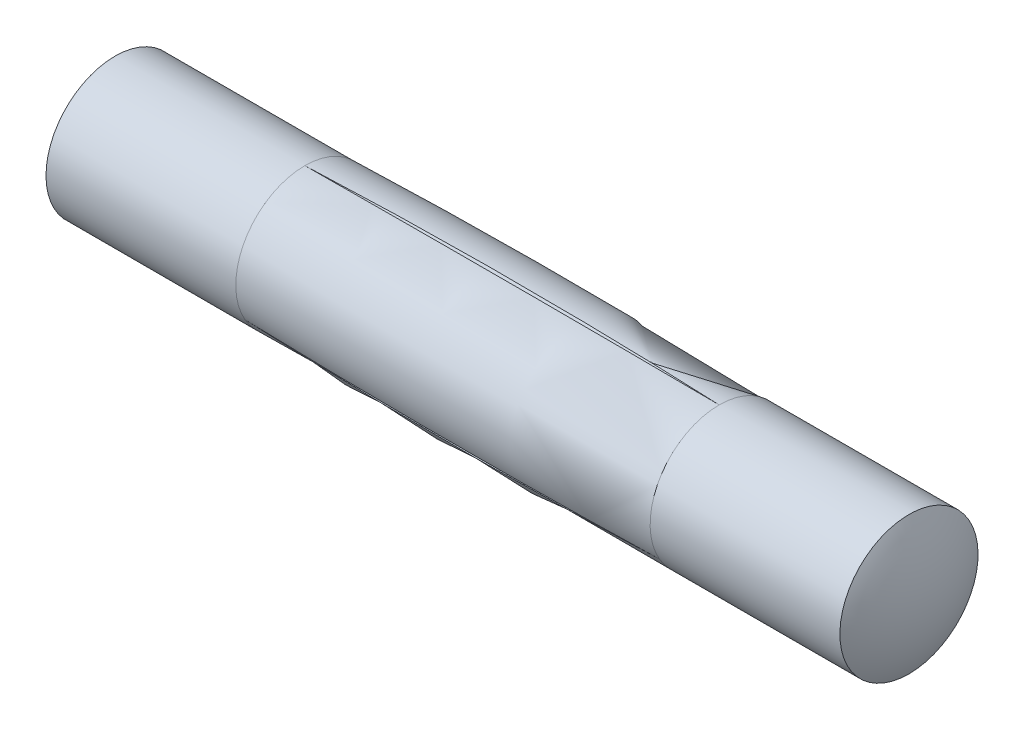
ISO-10303-21;
HEADER;
FILE_DESCRIPTION(('STEP AP214'),'2;1');
FILE_NAME('part.step','',(''),(''),'','','');
FILE_SCHEMA(('AUTOMOTIVE_DESIGN { 1 0 10303 214 1 1 1 1 }'));
ENDSEC;
DATA;
#1=APPLICATION_CONTEXT('core data for automotive mechanical design processes');
#2=APPLICATION_PROTOCOL_DEFINITION('international standard','automotive_design',2000,#1);
#3=PRODUCT_CONTEXT('',#1,'mechanical');
#4=PRODUCT('Part','Part','',(#3));
#5=PRODUCT_RELATED_PRODUCT_CATEGORY('part','',(#4));
#6=PRODUCT_DEFINITION_FORMATION('','',#4);
#7=PRODUCT_DEFINITION_CONTEXT('part definition',#1,'design');
#8=PRODUCT_DEFINITION('design','',#6,#7);
#9=PRODUCT_DEFINITION_SHAPE('','',#8);
#10=(LENGTH_UNIT() NAMED_UNIT(*) SI_UNIT(.MILLI.,.METRE.));
#11=(NAMED_UNIT(*) PLANE_ANGLE_UNIT() SI_UNIT($,.RADIAN.));
#12=(NAMED_UNIT(*) SI_UNIT($,.STERADIAN.) SOLID_ANGLE_UNIT());
#13=UNCERTAINTY_MEASURE_WITH_UNIT(LENGTH_MEASURE(1.E-05),#10,'distance_accuracy_value','');
#14=(GEOMETRIC_REPRESENTATION_CONTEXT(3) GLOBAL_UNCERTAINTY_ASSIGNED_CONTEXT((#13)) GLOBAL_UNIT_ASSIGNED_CONTEXT((#10,
#11,#12)) REPRESENTATION_CONTEXT('',''));
#15=CARTESIAN_POINT('',(0.,0.,0.));
#16=DIRECTION('',(0.,0.,1.));
#17=DIRECTION('',(1.,0.,0.));
#18=AXIS2_PLACEMENT_3D('',#15,#16,#17);
#19=CARTESIAN_POINT('',(0.,0.,0.));
#20=DIRECTION('',(-1.,0.,0.));
#21=DIRECTION('',(0.,0.,1.));
#22=AXIS2_PLACEMENT_3D('',#19,#20,#21);
#23=DEGENERATE_TOROIDAL_SURFACE('',#22,278.700000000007,281.300000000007,.F.);
#24=CARTESIAN_POINT('',(-7.5,0.,0.));
#25=DIRECTION('',(1.,0.,0.));
#26=DIRECTION('',(0.,0.,-1.));
#27=AXIS2_PLACEMENT_3D('',#24,#25,#26);
#28=CIRCLE('',#27,2.5);
#29=CARTESIAN_POINT('',(-7.5,-1.25000000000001,2.16506350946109));
#30=VERTEX_POINT('',#29);
#31=CARTESIAN_POINT('',(-7.5,-1.24999999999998,-2.16506350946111));
#32=VERTEX_POINT('',#31);
#33=EDGE_CURVE('E93',#30,#32,#28,.T.);
#34=ORIENTED_EDGE('',*,*,#33,.T.);
#35=CARTESIAN_POINT('',(-7.5002,-1.2499940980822,-2.16506075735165));
#36=CARTESIAN_POINT('',(-7.09450307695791,-1.26196494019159,-2.17064285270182));
#37=CARTESIAN_POINT('',(-6.68877093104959,-1.27292932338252,-2.1757556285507));
#38=CARTESIAN_POINT('',(-5.87724910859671,-1.29287496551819,-2.18505643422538));
#39=CARTESIAN_POINT('',(-5.47145943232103,-1.3018562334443,-2.18924446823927));
#40=CARTESIAN_POINT('',(-4.2541563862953,-1.32586747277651,-2.20044109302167));
#41=CARTESIAN_POINT('',(-3.44257061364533,-1.33796894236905,-2.2060841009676));
#42=CARTESIAN_POINT('',(-1.78665400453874,-1.35483163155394,-2.2139473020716));
#43=CARTESIAN_POINT('',(-0.942319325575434,-1.3592779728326,-2.21602066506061));
#44=CARTESIAN_POINT('',(0.746359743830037,-1.35991616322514,-2.21631825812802));
#45=CARTESIAN_POINT('',(1.59070413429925,-1.35610795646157,-2.21454246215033));
#46=CARTESIAN_POINT('',(3.27936808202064,-1.34020085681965,-2.20712485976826));
#47=CARTESIAN_POINT('',(4.12368763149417,-1.32810128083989,-2.20148273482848));
#48=CARTESIAN_POINT('',(5.81212227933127,-1.29543847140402,-2.18625181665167));
#49=CARTESIAN_POINT('',(6.65623737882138,-1.27487528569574,-2.17666304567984));
#50=CARTESIAN_POINT('',(7.5002,-1.24999409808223,-2.16506075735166));
#51=B_SPLINE_CURVE_WITH_KNOTS('',3,(#35,#36,#37,#38,#39,#40,#41,#42,#43,#44,#45,#46,#47,#48,#49,
#50),.UNSPECIFIED.,.F.,.F.,(4,2,2,2,2,2,2,4),(0.,1.2177323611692,2.4354592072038,
4.87049754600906,7.40349583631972,9.9365112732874,12.4697354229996,15.0029452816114),.UNSPECIFIED.);
#52=CARTESIAN_POINT('',(7.5,-1.24999999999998,-2.16506350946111));
#53=VERTEX_POINT('',#52);
#54=EDGE_CURVE('E55',#32,#53,#51,.T.);
#55=ORIENTED_EDGE('',*,*,#54,.T.);
#56=CARTESIAN_POINT('',(7.5,0.,0.));
#57=DIRECTION('',(-1.,0.,0.));
#58=DIRECTION('',(0.,0.,1.));
#59=AXIS2_PLACEMENT_3D('',#56,#57,#58);
#60=CIRCLE('',#59,2.5);
#61=CARTESIAN_POINT('',(7.5,-1.25000000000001,2.16506350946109));
#62=VERTEX_POINT('',#61);
#63=EDGE_CURVE('E90',#53,#62,#60,.T.);
#64=ORIENTED_EDGE('',*,*,#63,.T.);
#65=CARTESIAN_POINT('',(7.5002,-1.24999409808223,2.16506075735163));
#66=CARTESIAN_POINT('',(7.09450307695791,-1.26196494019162,2.17064285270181));
#67=CARTESIAN_POINT('',(6.68877093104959,-1.27292932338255,2.17575562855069));
#68=CARTESIAN_POINT('',(5.87724910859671,-1.29287496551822,2.18505643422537));
#69=CARTESIAN_POINT('',(5.47145943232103,-1.30185623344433,2.18924446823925));
#70=CARTESIAN_POINT('',(4.2541563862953,-1.32586747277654,2.20044109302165));
#71=CARTESIAN_POINT('',(3.44257061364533,-1.33796894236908,2.20608410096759));
#72=CARTESIAN_POINT('',(1.78665400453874,-1.35483163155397,2.21394730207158));
#73=CARTESIAN_POINT('',(0.942319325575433,-1.35927797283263,2.21602066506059));
#74=CARTESIAN_POINT('',(-0.74635974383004,-1.35991616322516,2.216318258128));
#75=CARTESIAN_POINT('',(-1.59070413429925,-1.3561079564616,2.21454246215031));
#76=CARTESIAN_POINT('',(-3.27936808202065,-1.34020085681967,2.20712485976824));
#77=CARTESIAN_POINT('',(-4.12368763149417,-1.32810128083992,2.20148273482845));
#78=CARTESIAN_POINT('',(-5.81212227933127,-1.29543847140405,2.18625181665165));
#79=CARTESIAN_POINT('',(-6.65623737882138,-1.27487528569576,2.17666304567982));
#80=CARTESIAN_POINT('',(-7.5002,-1.24999409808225,2.16506075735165));
#81=B_SPLINE_CURVE_WITH_KNOTS('',3,(#65,#66,#67,#68,#69,#70,#71,#72,#73,#74,#75,#76,#77,#78,#79,
#80),.UNSPECIFIED.,.F.,.F.,(4,2,2,2,2,2,2,4),(0.,1.21773236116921,2.4354592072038,
4.87049754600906,7.40349583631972,9.93651127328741,12.4697354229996,15.0029452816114),.UNSPECIFIED.);
#82=EDGE_CURVE('E94',#62,#30,#81,.T.);
#83=ORIENTED_EDGE('',*,*,#82,.T.);
#84=EDGE_LOOP('',(#34,#55,#64,#83));
#85=FACE_BOUND('',#84,.T.);
#86=ADVANCED_FACE('F35',(#85),#23,.F.);
#87=CARTESIAN_POINT('',(-7.5,2.5,0.));
#88=VERTEX_POINT('',#87);
#89=EDGE_CURVE('E107',#88,#30,#28,.T.);
#90=ORIENTED_EDGE('',*,*,#89,.T.);
#91=CARTESIAN_POINT('',(-7.5002,-1.2500005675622,2.16505702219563));
#92=CARTESIAN_POINT('',(-7.09450307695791,-1.2488493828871,2.17821512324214));
#93=CARTESIAN_POINT('',(-6.68877093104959,-1.24779498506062,2.19026694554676));
#94=CARTESIAN_POINT('',(-5.87724910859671,-1.24587689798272,2.21219078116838));
#95=CARTESIAN_POINT('',(-5.47145943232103,-1.2450132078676,2.22206280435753));
#96=CARTESIAN_POINT('',(-4.2541563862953,-1.2427041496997,2.24845545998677));
#97=CARTESIAN_POINT('',(-3.44257061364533,-1.24154040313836,2.26175714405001));
#98=CARTESIAN_POINT('',(-1.78665400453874,-1.23991879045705,2.28029226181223));
#99=CARTESIAN_POINT('',(-0.942319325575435,-1.23949120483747,2.28517958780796));
#100=CARTESIAN_POINT('',(0.746359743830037,-1.23942983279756,2.28588107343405));
#101=CARTESIAN_POINT('',(1.59070413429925,-1.23979605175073,2.28169517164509));
#102=CARTESIAN_POINT('',(3.27936808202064,-1.24132576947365,2.26421041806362));
#103=CARTESIAN_POINT('',(4.12368763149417,-1.24248933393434,2.25091081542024));
#104=CARTESIAN_POINT('',(5.81212227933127,-1.24563037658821,2.21500853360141));
#105=CARTESIAN_POINT('',(6.65623737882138,-1.24760785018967,2.19240590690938));
#106=CARTESIAN_POINT('',(7.5002,-1.25000056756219,2.16505702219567));
#107=B_SPLINE_CURVE_WITH_KNOTS('',3,(#91,#92,#93,#94,#95,#96,#97,#98,#99,#100,#101,#102,#103,
#104,#105,#106),.UNSPECIFIED.,.F.,.F.,(4,2,2,2,2,2,2,4),(0.,1.2177323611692,2.4354592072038,
4.87049754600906,7.40349583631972,9.9365112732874,12.4697354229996,15.0029452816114),.UNSPECIFIED.);
#108=EDGE_CURVE('E62',#30,#62,#107,.T.);
#109=ORIENTED_EDGE('',*,*,#108,.T.);
#110=CARTESIAN_POINT('',(7.5,2.5,0.));
#111=VERTEX_POINT('',#110);
#112=EDGE_CURVE('E101',#62,#111,#60,.T.);
#113=ORIENTED_EDGE('',*,*,#112,.T.);
#114=CARTESIAN_POINT('',(7.5002,2.49999466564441,-3.73515600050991E-06));
#115=CARTESIAN_POINT('',(7.09450307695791,2.51081432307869,0.00757227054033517));
#116=CARTESIAN_POINT('',(6.68877093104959,2.52072430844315,0.0145113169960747));
#117=CARTESIAN_POINT('',(5.87724910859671,2.53875186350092,0.0271343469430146));
#118=CARTESIAN_POINT('',(5.47145943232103,2.54686944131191,0.0328183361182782));
#119=CARTESIAN_POINT('',(4.2541563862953,2.56857162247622,0.0480143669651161));
#120=CARTESIAN_POINT('',(3.44257061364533,2.57950934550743,0.0556730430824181));
#121=CARTESIAN_POINT('',(1.78665400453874,2.59475042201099,0.0663449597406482));
#122=CARTESIAN_POINT('',(0.942319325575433,2.59876917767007,0.0691589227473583));
#123=CARTESIAN_POINT('',(-0.74635974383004,2.5993459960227,0.0695628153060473));
#124=CARTESIAN_POINT('',(-1.59070413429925,2.59590400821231,0.0671527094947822));
#125=CARTESIAN_POINT('',(-3.27936808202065,2.5815266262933,0.057085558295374));
#126=CARTESIAN_POINT('',(-4.12368763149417,2.57059061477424,0.0494280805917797));
#127=CARTESIAN_POINT('',(-5.81212227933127,2.54106884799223,0.0287567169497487));
#128=CARTESIAN_POINT('',(-6.65623737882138,2.52248313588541,0.0157428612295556));
#129=CARTESIAN_POINT('',(-7.5002,2.49999466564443,-3.73515598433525E-06));
#130=B_SPLINE_CURVE_WITH_KNOTS('',3,(#114,#115,#116,#117,#118,#119,#120,#121,#122,#123,#124,
#125,#126,#127,#128,#129),.UNSPECIFIED.,.F.,.F.,(4,2,2,2,2,2,2,4),(0.,1.21773236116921,
2.4354592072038,4.87049754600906,7.40349583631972,9.93651127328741,12.4697354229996,
15.0029452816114),.UNSPECIFIED.);
#131=EDGE_CURVE('E49',#111,#88,#130,.T.);
#132=ORIENTED_EDGE('',*,*,#131,.T.);
#133=EDGE_LOOP('',(#90,#109,#113,#132));
#134=FACE_BOUND('',#133,.T.);
#135=ADVANCED_FACE('F169',(#134),#23,.F.);
#136=CARTESIAN_POINT('',(-15.,0.,0.));
#137=DIRECTION('',(-1.,0.,0.));
#138=DIRECTION('',(0.,-1.,0.));
#139=AXIS2_PLACEMENT_3D('',#136,#137,#138);
#140=CYLINDRICAL_SURFACE('',#139,2.5);
#141=CARTESIAN_POINT('',(14.37,0.,0.));
#142=DIRECTION('',(-1.,0.,0.));
#143=DIRECTION('',(0.,-1.,0.));
#144=AXIS2_PLACEMENT_3D('',#141,#142,#143);
#145=CIRCLE('',#144,2.5);
#146=CARTESIAN_POINT('',(14.37,-2.5,0.));
#147=VERTEX_POINT('',#146);
#148=EDGE_CURVE('E114',#147,#147,#145,.T.);
#149=ORIENTED_EDGE('',*,*,#148,.T.);
#150=EDGE_LOOP('',(#149));
#151=FACE_BOUND('',#150,.T.);
#152=EDGE_CURVE('E100',#111,#53,#60,.T.);
#153=ORIENTED_EDGE('',*,*,#152,.F.);
#154=ORIENTED_EDGE('',*,*,#112,.F.);
#155=ORIENTED_EDGE('',*,*,#63,.F.);
#156=EDGE_LOOP('',(#153,#154,#155));
#157=FACE_BOUND('',#156,.T.);
#158=ADVANCED_FACE('F99',(#151,#157),#140,.T.);
#159=CARTESIAN_POINT('',(9.72468253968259,0.,0.));
#160=DIRECTION('',(-1.,0.,0.));
#161=DIRECTION('',(0.,-1.,0.));
#162=AXIS2_PLACEMENT_3D('',#159,#160,#161);
#163=SPHERICAL_SURFACE('',#162,5.27531746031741);
#164=ORIENTED_EDGE('',*,*,#148,.F.);
#165=EDGE_LOOP('',(#164));
#166=FACE_BOUND('',#165,.T.);
#167=ADVANCED_FACE('F176',(#166),#163,.T.);
#168=ORIENTED_EDGE('',*,*,#152,.T.);
#169=CARTESIAN_POINT('',(7.5002,-1.25000056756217,-2.16505702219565));
#170=CARTESIAN_POINT('',(7.09450307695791,-1.24884938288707,-2.17821512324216));
#171=CARTESIAN_POINT('',(6.68877093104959,-1.24779498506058,-2.19026694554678));
#172=CARTESIAN_POINT('',(5.87724910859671,-1.24587689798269,-2.2121907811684));
#173=CARTESIAN_POINT('',(5.47145943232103,-1.24501320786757,-2.22206280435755));
#174=CARTESIAN_POINT('',(4.2541563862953,-1.24270414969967,-2.24845545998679));
#175=CARTESIAN_POINT('',(3.44257061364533,-1.24154040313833,-2.26175714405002));
#176=CARTESIAN_POINT('',(1.78665400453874,-1.23991879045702,-2.28029226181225));
#177=CARTESIAN_POINT('',(0.942319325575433,-1.23949120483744,-2.28517958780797));
#178=CARTESIAN_POINT('',(-0.74635974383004,-1.23942983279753,-2.28588107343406));
#179=CARTESIAN_POINT('',(-1.59070413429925,-1.23979605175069,-2.28169517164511));
#180=CARTESIAN_POINT('',(-3.27936808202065,-1.24132576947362,-2.26421041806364));
#181=CARTESIAN_POINT('',(-4.12368763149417,-1.24248933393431,-2.25091081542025));
#182=CARTESIAN_POINT('',(-5.81212227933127,-1.24563037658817,-2.21500853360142));
#183=CARTESIAN_POINT('',(-6.65623737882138,-1.24760785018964,-2.19240590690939));
#184=CARTESIAN_POINT('',(-7.5002,-1.25000056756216,-2.16505702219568));
#185=B_SPLINE_CURVE_WITH_KNOTS('',3,(#169,#170,#171,#172,#173,#174,#175,#176,#177,#178,#179,
#180,#181,#182,#183,#184),.UNSPECIFIED.,.F.,.F.,(4,2,2,2,2,2,2,4),(0.,1.21773236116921,
2.4354592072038,4.87049754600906,7.40349583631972,9.93651127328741,12.4697354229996,
15.0029452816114),.UNSPECIFIED.);
#186=EDGE_CURVE('E77',#53,#32,#185,.T.);
#187=ORIENTED_EDGE('',*,*,#186,.T.);
#188=EDGE_CURVE('E111',#32,#88,#28,.T.);
#189=ORIENTED_EDGE('',*,*,#188,.T.);
#190=CARTESIAN_POINT('',(-7.5002,2.49999466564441,3.73515600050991E-06));
#191=CARTESIAN_POINT('',(-7.09450307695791,2.51081432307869,-0.00757227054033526));
#192=CARTESIAN_POINT('',(-6.68877093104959,2.52072430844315,-0.0145113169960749));
#193=CARTESIAN_POINT('',(-5.87724910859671,2.53875186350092,-0.027134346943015));
#194=CARTESIAN_POINT('',(-5.47145943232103,2.54686944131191,-0.0328183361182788));
#195=CARTESIAN_POINT('',(-4.2541563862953,2.56857162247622,-0.0480143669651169));
#196=CARTESIAN_POINT('',(-3.44257061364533,2.57950934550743,-0.055673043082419));
#197=CARTESIAN_POINT('',(-1.78665400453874,2.594750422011,-0.0663449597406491));
#198=CARTESIAN_POINT('',(-0.942319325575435,2.59876917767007,-0.0691589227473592));
#199=CARTESIAN_POINT('',(0.746359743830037,2.5993459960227,-0.0695628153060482));
#200=CARTESIAN_POINT('',(1.59070413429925,2.59590400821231,-0.0671527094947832));
#201=CARTESIAN_POINT('',(3.27936808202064,2.5815266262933,-0.0570855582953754));
#202=CARTESIAN_POINT('',(4.12368763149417,2.57059061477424,-0.0494280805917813));
#203=CARTESIAN_POINT('',(5.81212227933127,2.54106884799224,-0.0287567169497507));
#204=CARTESIAN_POINT('',(6.65623737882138,2.52248313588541,-0.015742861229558));
#205=CARTESIAN_POINT('',(7.5002,2.49999466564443,3.73515598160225E-06));
#206=B_SPLINE_CURVE_WITH_KNOTS('',3,(#190,#191,#192,#193,#194,#195,#196,#197,#198,#199,#200,
#201,#202,#203,#204,#205),.UNSPECIFIED.,.F.,.F.,(4,2,2,2,2,2,2,4),(0.,1.2177323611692,
2.4354592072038,4.87049754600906,7.40349583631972,9.9365112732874,12.4697354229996,
15.0029452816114),.UNSPECIFIED.);
#207=EDGE_CURVE('E11',#88,#111,#206,.T.);
#208=ORIENTED_EDGE('',*,*,#207,.T.);
#209=EDGE_LOOP('',(#168,#187,#189,#208));
#210=FACE_BOUND('',#209,.T.);
#211=ADVANCED_FACE('F103',(#210),#23,.F.);
#212=CARTESIAN_POINT('',(-9.72468253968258,0.,0.));
#213=DIRECTION('',(-1.,0.,0.));
#214=DIRECTION('',(0.,1.,0.));
#215=AXIS2_PLACEMENT_3D('',#212,#213,#214);
#216=SPHERICAL_SURFACE('',#215,5.27531746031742);
#217=CARTESIAN_POINT('',(-14.37,0.,0.));
#218=DIRECTION('',(-1.,0.,0.));
#219=DIRECTION('',(0.,-1.,0.));
#220=AXIS2_PLACEMENT_3D('',#217,#218,#219);
#221=CIRCLE('',#220,2.5);
#222=CARTESIAN_POINT('',(-14.37,-2.5,0.));
#223=VERTEX_POINT('',#222);
#224=EDGE_CURVE('E117',#223,#223,#221,.T.);
#225=ORIENTED_EDGE('',*,*,#224,.T.);
#226=EDGE_LOOP('',(#225));
#227=FACE_BOUND('',#226,.T.);
#228=ADVANCED_FACE('F37',(#227),#216,.T.);
#229=ORIENTED_EDGE('',*,*,#224,.F.);
#230=EDGE_LOOP('',(#229));
#231=FACE_BOUND('',#230,.T.);
#232=ORIENTED_EDGE('',*,*,#89,.F.);
#233=ORIENTED_EDGE('',*,*,#188,.F.);
#234=ORIENTED_EDGE('',*,*,#33,.F.);
#235=EDGE_LOOP('',(#232,#233,#234));
#236=FACE_BOUND('',#235,.T.);
#237=ADVANCED_FACE('F181',(#231,#236),#140,.T.);
#238=CARTESIAN_POINT('',(-7.5,2.5,0.));
#239=DIRECTION('',(0.,-0.57357643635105,-0.819152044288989));
#240=DIRECTION('',(0.,0.819152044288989,-0.57357643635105));
#241=AXIS2_PLACEMENT_3D('',#238,#239,#240);
#242=PLANE('',#241);
#243=DIRECTION('',(1.,0.,0.));
#244=VECTOR('',#243,1.);
#245=CARTESIAN_POINT('',(-7.5,2.5,0.));
#246=LINE('',#245,#244);
#247=EDGE_CURVE('E121',#88,#111,#246,.T.);
#248=ORIENTED_EDGE('',*,*,#247,.T.);
#249=ORIENTED_EDGE('',*,*,#207,.F.);
#250=EDGE_LOOP('',(#248,#249));
#251=FACE_BOUND('',#250,.T.);
#252=ADVANCED_FACE('F190',(#251),#242,.F.);
#253=CARTESIAN_POINT('',(-7.5,2.5,0.));
#254=DIRECTION('',(0.,-0.57357643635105,0.819152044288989));
#255=DIRECTION('',(0.,-0.819152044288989,-0.57357643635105));
#256=AXIS2_PLACEMENT_3D('',#253,#254,#255);
#257=PLANE('',#256);
#258=ORIENTED_EDGE('',*,*,#247,.F.);
#259=ORIENTED_EDGE('',*,*,#131,.F.);
#260=EDGE_LOOP('',(#258,#259));
#261=FACE_BOUND('',#260,.T.);
#262=ADVANCED_FACE('F142',(#261),#257,.F.);
#263=CARTESIAN_POINT('',(-7.5,-1.25000000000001,2.16506350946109));
#264=DIRECTION('',(0.,0.996194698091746,-0.0871557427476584));
#265=DIRECTION('',(0.,0.0871557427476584,0.996194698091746));
#266=AXIS2_PLACEMENT_3D('',#263,#264,#265);
#267=PLANE('',#266);
#268=DIRECTION('',(1.,0.,0.));
#269=VECTOR('',#268,1.);
#270=CARTESIAN_POINT('',(-7.5,-1.25000000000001,2.16506350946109));
#271=LINE('',#270,#269);
#272=EDGE_CURVE('E133',#30,#62,#271,.T.);
#273=ORIENTED_EDGE('',*,*,#272,.T.);
#274=ORIENTED_EDGE('',*,*,#108,.F.);
#275=EDGE_LOOP('',(#273,#274));
#276=FACE_BOUND('',#275,.T.);
#277=ADVANCED_FACE('F137',(#276),#267,.F.);
#278=CARTESIAN_POINT('',(-7.5,-1.25000000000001,2.16506350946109));
#279=DIRECTION('',(0.,-0.422618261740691,-0.906307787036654));
#280=DIRECTION('',(0.,0.906307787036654,-0.422618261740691));
#281=AXIS2_PLACEMENT_3D('',#278,#279,#280);
#282=PLANE('',#281);
#283=ORIENTED_EDGE('',*,*,#272,.F.);
#284=ORIENTED_EDGE('',*,*,#82,.F.);
#285=EDGE_LOOP('',(#283,#284));
#286=FACE_BOUND('',#285,.T.);
#287=ADVANCED_FACE('F141',(#286),#282,.F.);
#288=CARTESIAN_POINT('',(-7.5,-1.24999999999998,-2.16506350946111));
#289=DIRECTION('',(0.,-0.422618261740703,0.906307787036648));
#290=DIRECTION('',(0.,-0.906307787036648,-0.422618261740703));
#291=AXIS2_PLACEMENT_3D('',#288,#289,#290);
#292=PLANE('',#291);
#293=DIRECTION('',(1.,0.,0.));
#294=VECTOR('',#293,1.);
#295=CARTESIAN_POINT('',(-7.5,-1.24999999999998,-2.16506350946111));
#296=LINE('',#295,#294);
#297=EDGE_CURVE('E79',#32,#53,#296,.T.);
#298=ORIENTED_EDGE('',*,*,#297,.T.);
#299=ORIENTED_EDGE('',*,*,#54,.F.);
#300=EDGE_LOOP('',(#298,#299));
#301=FACE_BOUND('',#300,.T.);
#302=ADVANCED_FACE('F84',(#301),#292,.F.);
#303=CARTESIAN_POINT('',(-7.5,-1.24999999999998,-2.16506350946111));
#304=DIRECTION('',(0.,0.996194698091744,0.0871557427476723));
#305=DIRECTION('',(0.,-0.0871557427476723,0.996194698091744));
#306=AXIS2_PLACEMENT_3D('',#303,#304,#305);
#307=PLANE('',#306);
#308=ORIENTED_EDGE('',*,*,#297,.F.);
#309=ORIENTED_EDGE('',*,*,#186,.F.);
#310=EDGE_LOOP('',(#308,#309));
#311=FACE_BOUND('',#310,.T.);
#312=ADVANCED_FACE('F78',(#311),#307,.F.);
#313=CLOSED_SHELL('',(#86,#135,#158,#167,#211,#228,#237,#252,#262,#277,#287,#302,#312));
#314=MANIFOLD_SOLID_BREP('B2',#313);
#315=ADVANCED_BREP_SHAPE_REPRESENTATION('',(#18,#314),#14);
#316=SHAPE_DEFINITION_REPRESENTATION(#9,#315);
ENDSEC;
END-ISO-10303-21;
